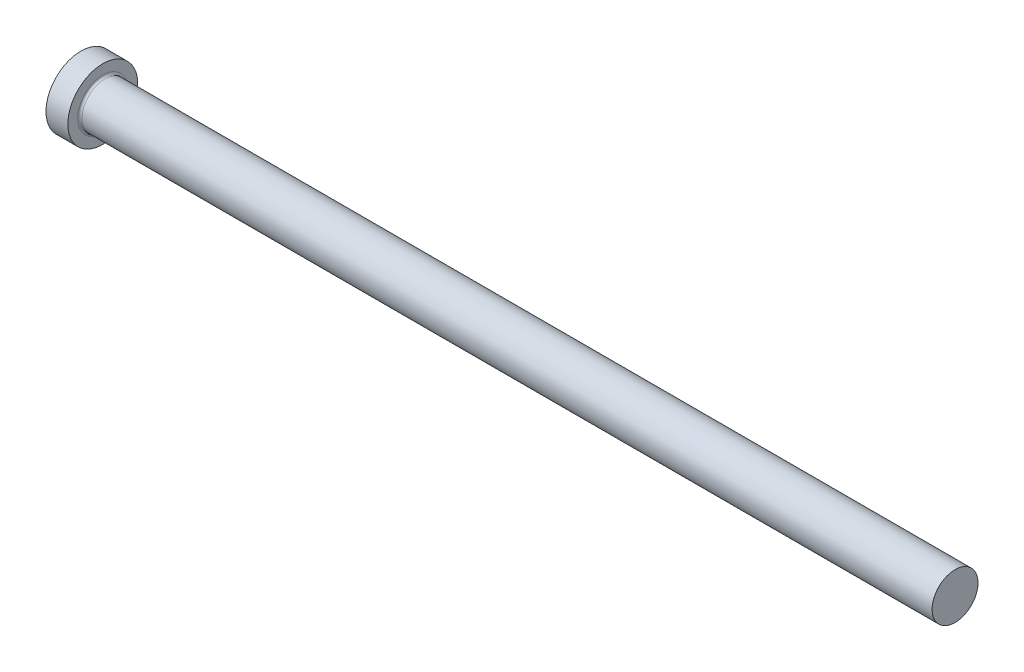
ISO-10303-21;
HEADER;
FILE_DESCRIPTION(('STEP AP214'),'2;1');
FILE_NAME('part.step','',(''),(''),'','','');
FILE_SCHEMA(('AUTOMOTIVE_DESIGN { 1 0 10303 214 1 1 1 1 }'));
ENDSEC;
DATA;
#1=APPLICATION_CONTEXT('core data for automotive mechanical design processes');
#2=APPLICATION_PROTOCOL_DEFINITION('international standard','automotive_design',2000,#1);
#3=PRODUCT_CONTEXT('',#1,'mechanical');
#4=PRODUCT('Part','Part','',(#3));
#5=PRODUCT_RELATED_PRODUCT_CATEGORY('part','',(#4));
#6=PRODUCT_DEFINITION_FORMATION('','',#4);
#7=PRODUCT_DEFINITION_CONTEXT('part definition',#1,'design');
#8=PRODUCT_DEFINITION('design','',#6,#7);
#9=PRODUCT_DEFINITION_SHAPE('','',#8);
#10=(LENGTH_UNIT() NAMED_UNIT(*) SI_UNIT(.MILLI.,.METRE.));
#11=(NAMED_UNIT(*) PLANE_ANGLE_UNIT() SI_UNIT($,.RADIAN.));
#12=(NAMED_UNIT(*) SI_UNIT($,.STERADIAN.) SOLID_ANGLE_UNIT());
#13=UNCERTAINTY_MEASURE_WITH_UNIT(LENGTH_MEASURE(1.E-05),#10,'distance_accuracy_value','');
#14=(GEOMETRIC_REPRESENTATION_CONTEXT(3) GLOBAL_UNCERTAINTY_ASSIGNED_CONTEXT((#13)) GLOBAL_UNIT_ASSIGNED_CONTEXT((#10,
#11,#12)) REPRESENTATION_CONTEXT('',''));
#15=CARTESIAN_POINT('',(0.,0.,0.));
#16=DIRECTION('',(0.,0.,1.));
#17=DIRECTION('',(1.,0.,0.));
#18=AXIS2_PLACEMENT_3D('',#15,#16,#17);
#19=CARTESIAN_POINT('',(0.,0.,0.));
#20=DIRECTION('',(-1.,0.,0.));
#21=DIRECTION('',(0.,-1.,0.));
#22=AXIS2_PLACEMENT_3D('',#19,#20,#21);
#23=PLANE('',#22);
#24=CARTESIAN_POINT('',(0.,0.,0.));
#25=DIRECTION('',(1.,0.,0.));
#26=DIRECTION('',(0.,1.,0.));
#27=AXIS2_PLACEMENT_3D('',#24,#25,#26);
#28=CIRCLE('',#27,8.);
#29=CARTESIAN_POINT('',(0.,8.,0.));
#30=VERTEX_POINT('',#29);
#31=EDGE_CURVE('E25',#30,#30,#28,.T.);
#32=ORIENTED_EDGE('',*,*,#31,.F.);
#33=EDGE_LOOP('',(#32));
#34=FACE_BOUND('',#33,.T.);
#35=ADVANCED_FACE('F14',(#34),#23,.T.);
#36=CARTESIAN_POINT('',(200.,0.,0.));
#37=DIRECTION('',(1.,0.,0.));
#38=DIRECTION('',(0.,1.,0.));
#39=AXIS2_PLACEMENT_3D('',#36,#37,#38);
#40=CYLINDRICAL_SURFACE('',#39,8.);
#41=ORIENTED_EDGE('',*,*,#31,.T.);
#42=EDGE_LOOP('',(#41));
#43=FACE_BOUND('',#42,.T.);
#44=CARTESIAN_POINT('',(5.,0.,0.));
#45=DIRECTION('',(1.,0.,0.));
#46=DIRECTION('',(0.,1.,0.));
#47=AXIS2_PLACEMENT_3D('',#44,#45,#46);
#48=CIRCLE('',#47,8.);
#49=CARTESIAN_POINT('',(5.,8.,0.));
#50=VERTEX_POINT('',#49);
#51=EDGE_CURVE('E29',#50,#50,#48,.T.);
#52=ORIENTED_EDGE('',*,*,#51,.F.);
#53=EDGE_LOOP('',(#52));
#54=FACE_BOUND('',#53,.T.);
#55=ADVANCED_FACE('F51',(#43,#54),#40,.T.);
#56=CARTESIAN_POINT('',(5.,8.,0.));
#57=DIRECTION('',(1.,0.,0.));
#58=DIRECTION('',(0.,1.,0.));
#59=AXIS2_PLACEMENT_3D('',#56,#57,#58);
#60=PLANE('',#59);
#61=CARTESIAN_POINT('',(5.,0.,0.));
#62=DIRECTION('',(1.,0.,0.));
#63=DIRECTION('',(0.,1.,0.));
#64=AXIS2_PLACEMENT_3D('',#61,#62,#63);
#65=CIRCLE('',#64,5.75);
#66=CARTESIAN_POINT('',(5.,5.75,0.));
#67=VERTEX_POINT('',#66);
#68=EDGE_CURVE('E9',#67,#67,#65,.F.);
#69=ORIENTED_EDGE('',*,*,#68,.T.);
#70=EDGE_LOOP('',(#69));
#71=FACE_BOUND('',#70,.T.);
#72=ORIENTED_EDGE('',*,*,#51,.T.);
#73=EDGE_LOOP('',(#72));
#74=FACE_BOUND('',#73,.T.);
#75=ADVANCED_FACE('F42',(#71,#74),#60,.T.);
#76=CARTESIAN_POINT('',(200.,0.,0.));
#77=DIRECTION('',(1.,0.,0.));
#78=DIRECTION('',(0.,1.,0.));
#79=AXIS2_PLACEMENT_3D('',#76,#77,#78);
#80=CYLINDRICAL_SURFACE('',#79,5.25);
#81=CARTESIAN_POINT('',(5.5,0.,0.));
#82=DIRECTION('',(1.,0.,0.));
#83=DIRECTION('',(0.,1.,0.));
#84=AXIS2_PLACEMENT_3D('',#81,#82,#83);
#85=CIRCLE('',#84,5.25);
#86=CARTESIAN_POINT('',(5.5,5.25,0.));
#87=VERTEX_POINT('',#86);
#88=EDGE_CURVE('E21',#87,#87,#85,.T.);
#89=ORIENTED_EDGE('',*,*,#88,.T.);
#90=EDGE_LOOP('',(#89));
#91=FACE_BOUND('',#90,.T.);
#92=CARTESIAN_POINT('',(200.,0.,0.));
#93=DIRECTION('',(1.,0.,0.));
#94=DIRECTION('',(0.,1.,0.));
#95=AXIS2_PLACEMENT_3D('',#92,#93,#94);
#96=CIRCLE('',#95,5.25);
#97=CARTESIAN_POINT('',(200.,5.25000000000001,0.));
#98=VERTEX_POINT('',#97);
#99=EDGE_CURVE('E34',#98,#98,#96,.T.);
#100=ORIENTED_EDGE('',*,*,#99,.F.);
#101=EDGE_LOOP('',(#100));
#102=FACE_BOUND('',#101,.T.);
#103=ADVANCED_FACE('F40',(#91,#102),#80,.T.);
#104=CARTESIAN_POINT('',(200.,5.25,0.));
#105=DIRECTION('',(1.,0.,0.));
#106=DIRECTION('',(0.,1.,0.));
#107=AXIS2_PLACEMENT_3D('',#104,#105,#106);
#108=PLANE('',#107);
#109=ORIENTED_EDGE('',*,*,#99,.T.);
#110=EDGE_LOOP('',(#109));
#111=FACE_BOUND('',#110,.T.);
#112=ADVANCED_FACE('F38',(#111),#108,.T.);
#113=CARTESIAN_POINT('',(5.5,0.,0.));
#114=DIRECTION('',(1.,0.,0.));
#115=DIRECTION('',(0.,1.,0.));
#116=AXIS2_PLACEMENT_3D('',#113,#114,#115);
#117=TOROIDAL_SURFACE('',#116,5.75,0.5);
#118=ORIENTED_EDGE('',*,*,#68,.F.);
#119=EDGE_LOOP('',(#118));
#120=FACE_BOUND('',#119,.T.);
#121=ORIENTED_EDGE('',*,*,#88,.F.);
#122=EDGE_LOOP('',(#121));
#123=FACE_BOUND('',#122,.T.);
#124=ADVANCED_FACE('F16',(#120,#123),#117,.F.);
#125=CLOSED_SHELL('',(#35,#55,#75,#103,#112,#124));
#126=MANIFOLD_SOLID_BREP('B1',#125);
#127=ADVANCED_BREP_SHAPE_REPRESENTATION('',(#18,#126),#14);
#128=SHAPE_DEFINITION_REPRESENTATION(#9,#127);
ENDSEC;
END-ISO-10303-21;
